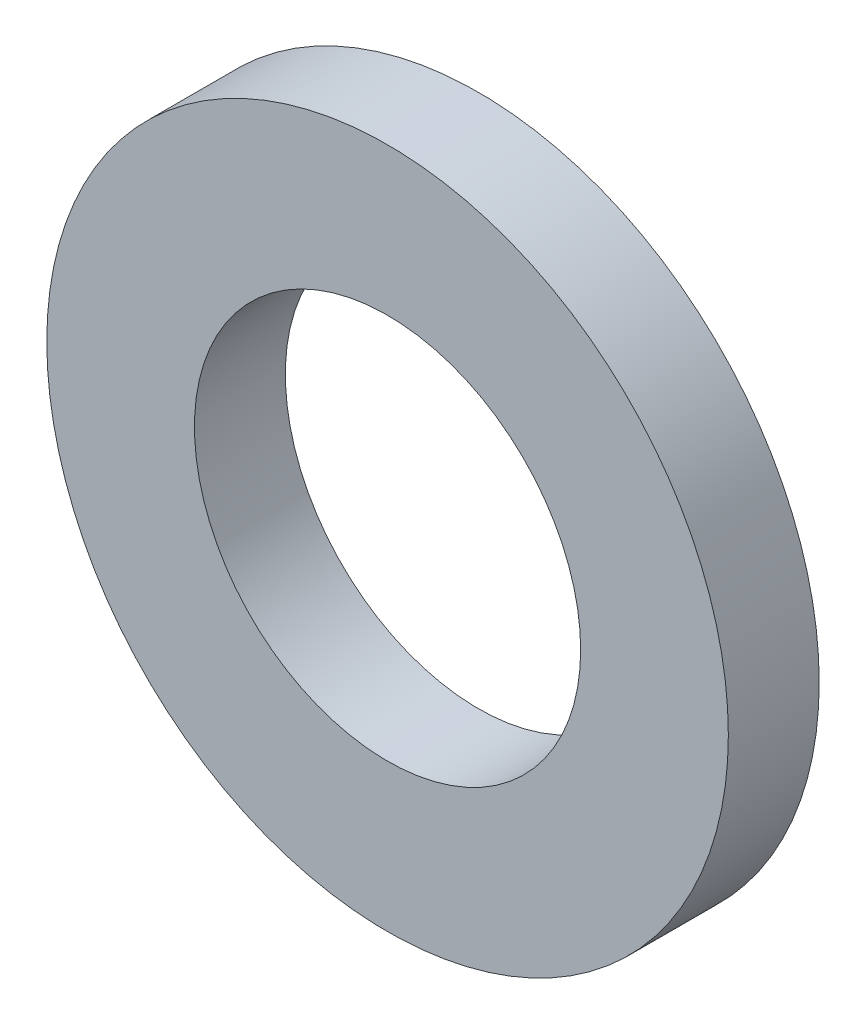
from build123d import *

# Parameters (mm, degrees)
SKETCH1_R           = 3.81
SKETCH1_R_2         = 2.159
BOSS_EXTRUDE1_DEPTH = 1.016


with BuildPart() as part:
    # Sketch1 → Boss-Extrude1 (new body)
    with BuildSketch(Plane.XY):
        Circle(SKETCH1_R)
        Circle(SKETCH1_R_2, mode=Mode.SUBTRACT)
    extrude(amount=BOSS_EXTRUDE1_DEPTH)


solid = part.part
